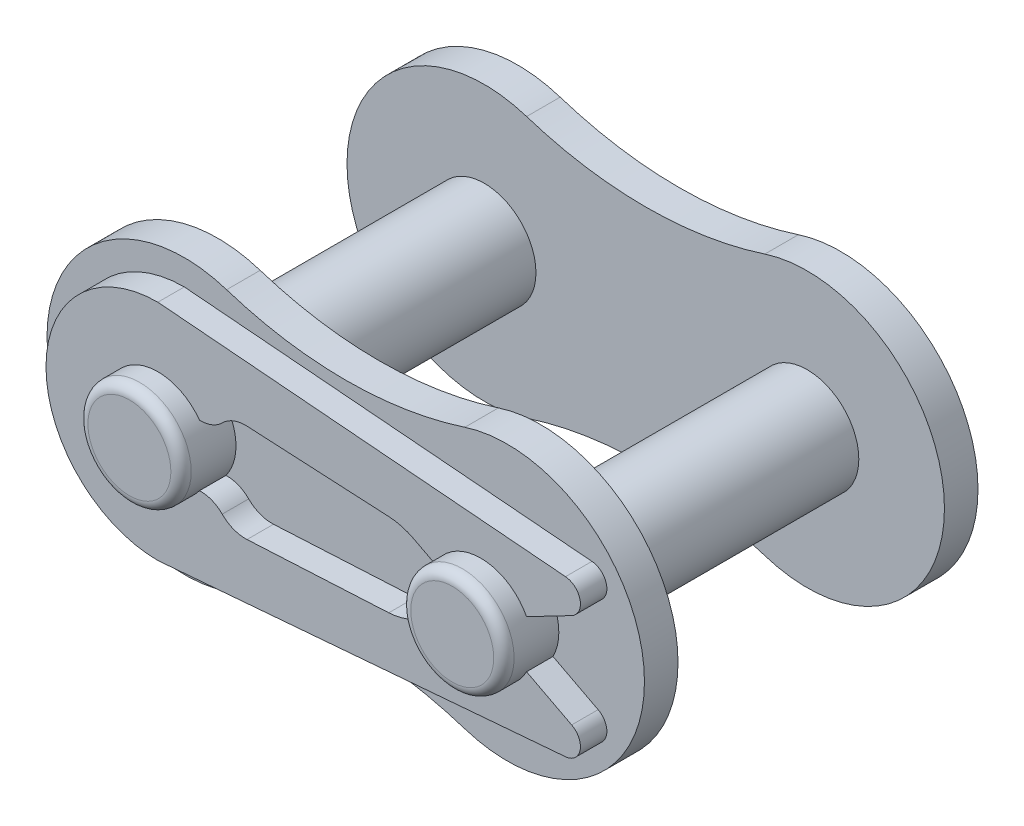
from build123d import *

# Parameters (mm, degrees)
BOSS_EXTRUDE1_START = 1.65
SKETCH3_R           = 2.54
BOSS_EXTRUDE1_DEPTH = 1.65
BOSS_EXTRUDE2_START = 1.3
BOSS_EXTRUDE2_DEPTH = 1.3


with BuildPart() as part:
    # Sketch1 → Revolve1 (revolve)
    with BuildSketch(Plane(origin=(0, 0, 0), x_dir=(1, 0, 0), z_dir=(0, 1, 0)), mode=Mode.PRIVATE) as revolve1_sk:
        with BuildLine():
            Line((0, -10.9), (0, 9.6))
            ThreePointArc((0, 9.6), (2.166217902, 9.240352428), (4.1, 8.2))
            Line((4.1, 8.2), (2.54, 8.2))
            Line((2.54, 8.2), (2.54, -10.4))
            ThreePointArc((2.54, -10.4), (2.393553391, -10.753553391), (2.04, -10.9))
            Line((2.04, -10.9), (0, -10.9))
        make_face()
    revolve(revolve1_sk.sketch.rotate(Axis((0, 0, -10.625), (0, 0, 1)), 180), axis=Axis((0, 0, -10.625), (0, 0, 1)))



with BuildPart() as body_2:
    # Sketch2 → Revolve2 (revolve)
    with BuildSketch(Plane.XZ, mode=Mode.PRIVATE) as revolve2_sk:
        with BuildLine():
            Line((-15.875, 10.9), (-17.915, 10.9))
            ThreePointArc((-17.915, 10.9), (-18.268553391, 10.753553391), (-18.415, 10.4))
            Line((-18.415, 10.4), (-18.415, -8.2))
            Line((-18.415, -8.2), (-19.975, -8.2))
            ThreePointArc((-19.975, -8.2), (-18.041217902, -9.240352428), (-15.875, -9.6))
            Line((-15.875, -9.6), (-15.875, 10.9))
        make_face()
    revolve(revolve2_sk.sketch.rotate(Axis((-15.875, 0, 10.9), (0, 0, -1)), 180), axis=Axis((-15.875, 0, 10.9), (0, 0, -1)))


with BuildPart() as part_1:
    add(part.part)

    add(body_2.part)  # Boss-Extrude1 merges body 2
    # Sketch3 → Boss-Extrude1 (add)
    with BuildSketch(Plane(origin=(0, 0, -8.2), x_dir=(0, 1, 0), z_dir=(0, 0, 1)).offset(BOSS_EXTRUDE1_START)):
        with BuildLine():
            ThreePointArc((-6.421306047, 2.080703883), (0, -6.75), (6.421306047, 2.080703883))
            ThreePointArc((6.421306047, 2.080703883), (5.496093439, 7.9375), (6.421306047, 13.794296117))
            ThreePointArc((6.421306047, 13.794296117), (0, 22.625), (-6.421306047, 13.794296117))
            ThreePointArc((-6.421306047, 13.794296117), (-5.496093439, 7.9375), (-6.421306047, 2.080703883))
        make_face()
        with Locations(Location((0, 0, 0), (0, 0, 90))):
            Circle(SKETCH3_R, mode=Mode.SUBTRACT)
        with Locations(Location((0, 15.875, 0), (0, 0, 270))):
            Circle(SKETCH3_R, mode=Mode.SUBTRACT)
    boss_extrude1 = extrude(amount=-BOSS_EXTRUDE1_DEPTH)

    # Mirror1: Boss-Extrude1 across plane
    add(boss_extrude1.mirror(Plane.XY))

    # Sketch4 → Boss-Extrude2 (add)
    with BuildSketch(Plane.XY.offset(8.2).offset(BOSS_EXTRUDE2_START)):
        with BuildLine():
            Line((4.168264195, 3.834533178), (-15.875, 5.5))
            ThreePointArc((-15.875, 5.5), (-21.375, 0), (-15.875, -5.5))
            Line((-15.875, -5.5), (4.168264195, -3.834533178))
            ThreePointArc((4.168264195, -3.834533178), (4.886303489, -3.195064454), (4.471416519, -2.327672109))
            Line((4.471416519, -2.327672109), (2.253007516, -1.172841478))
            ThreePointArc((2.253007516, -1.172841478), (0, -2.54), (-2.253007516, -1.172841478))
            Line((-2.253007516, -1.172841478), (-3.291734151, -1.713568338))
            ThreePointArc((-3.291734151, -1.713568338), (-3.887886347, -1.94689781), (-4.519972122, -2.048424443))
            Line((-4.519972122, -2.048424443), (-11.49126247, -2.413774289))
            ThreePointArc((-11.49126247, -2.413774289), (-12.151107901, -2.308649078), (-12.710483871, -1.943209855))
            ThreePointArc((-12.710483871, -1.943209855), (-13.222010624, -1.605653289), (-13.825850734, -1.50086218))
            ThreePointArc((-13.825850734, -1.50086218), (-18.415, 0), (-13.825850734, 1.50086218))
            ThreePointArc((-13.825850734, 1.50086218), (-13.222010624, 1.605653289), (-12.710483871, 1.943209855))
            ThreePointArc((-12.710483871, 1.943209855), (-12.151107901, 2.308649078), (-11.49126247, 2.413774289))
            Line((-11.49126247, 2.413774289), (-4.519972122, 2.048424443))
            ThreePointArc((-4.519972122, 2.048424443), (-3.887886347, 1.94689781), (-3.291734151, 1.713568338))
            Line((-3.291734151, 1.713568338), (-2.253007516, 1.172841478))
            ThreePointArc((-2.253007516, 1.172841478), (0, 2.54), (2.253007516, 1.172841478))
            Line((2.253007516, 1.172841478), (4.471416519, 2.327672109))
            ThreePointArc((4.471416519, 2.327672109), (4.886303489, 3.195064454), (4.168264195, 3.834533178))
        make_face()
    extrude(amount=-BOSS_EXTRUDE2_DEPTH)


solid = part_1.part
